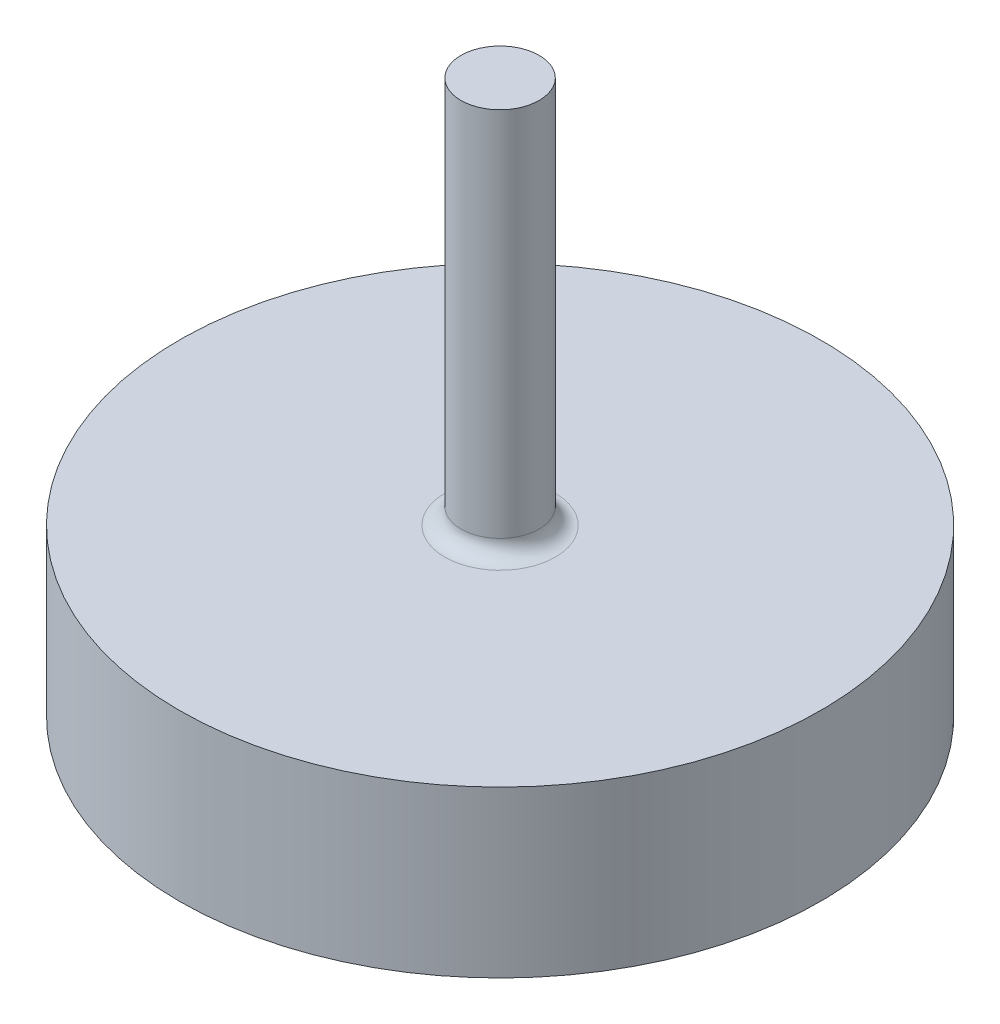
from build123d import *

# Parameters (mm, degrees)
FILLET1_R = 1.27


with BuildPart() as part:
    # Sketch1 → Revolve1 (revolve)
    with BuildSketch(Plane.XY, mode=Mode.PRIVATE) as revolve1_sk:
        Polygon((0, 0), (0, -43.307), (-25.1333, -43.307), (-25.1333, -30.353), (-3.0607, -30.353), (-3.0607, 0), align=None)
    revolve(revolve1_sk.sketch.rotate(Axis((0, 34.996489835, 0), (0, -1, 0)), 270), axis=Axis((0, 34.996489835, 0), (0, -1, 0)))

    # Fillet1
    fillet1_edges = [part.edges().sort_by_distance(p)[0] for p in [
        (0, -30.353, -3.0607),
    ]]
    fillet(fillet1_edges, radius=FILLET1_R)


solid = part.part
